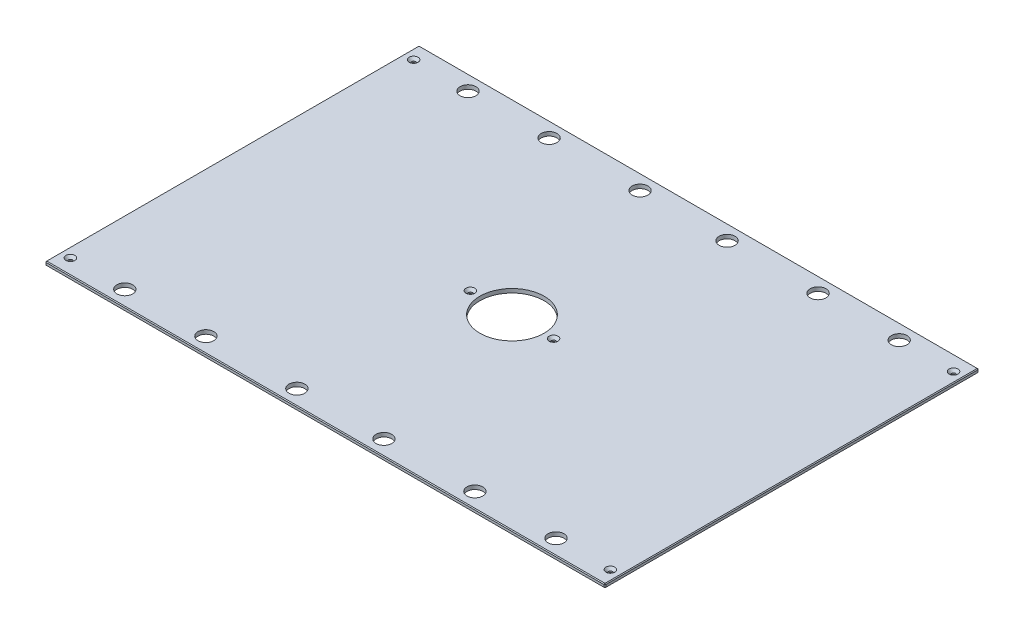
ISO-10303-21;
HEADER;
FILE_DESCRIPTION(('STEP AP214'),'2;1');
FILE_NAME('part.step','',(''),(''),'','','');
FILE_SCHEMA(('AUTOMOTIVE_DESIGN { 1 0 10303 214 1 1 1 1 }'));
ENDSEC;
DATA;
#1=APPLICATION_CONTEXT('core data for automotive mechanical design processes');
#2=APPLICATION_PROTOCOL_DEFINITION('international standard','automotive_design',2000,#1);
#3=PRODUCT_CONTEXT('',#1,'mechanical');
#4=PRODUCT('Part','Part','',(#3));
#5=PRODUCT_RELATED_PRODUCT_CATEGORY('part','',(#4));
#6=PRODUCT_DEFINITION_FORMATION('','',#4);
#7=PRODUCT_DEFINITION_CONTEXT('part definition',#1,'design');
#8=PRODUCT_DEFINITION('design','',#6,#7);
#9=PRODUCT_DEFINITION_SHAPE('','',#8);
#10=(LENGTH_UNIT() NAMED_UNIT(*) SI_UNIT(.MILLI.,.METRE.));
#11=(NAMED_UNIT(*) PLANE_ANGLE_UNIT() SI_UNIT($,.RADIAN.));
#12=(NAMED_UNIT(*) SI_UNIT($,.STERADIAN.) SOLID_ANGLE_UNIT());
#13=UNCERTAINTY_MEASURE_WITH_UNIT(LENGTH_MEASURE(1.E-05),#10,'distance_accuracy_value','');
#14=(GEOMETRIC_REPRESENTATION_CONTEXT(3) GLOBAL_UNCERTAINTY_ASSIGNED_CONTEXT((#13)) GLOBAL_UNIT_ASSIGNED_CONTEXT((#10,
#11,#12)) REPRESENTATION_CONTEXT('',''));
#15=CARTESIAN_POINT('',(0.,0.,0.));
#16=DIRECTION('',(0.,0.,1.));
#17=DIRECTION('',(1.,0.,0.));
#18=AXIS2_PLACEMENT_3D('',#15,#16,#17);
#19=CARTESIAN_POINT('',(-449.2625,6.35,-300.0375));
#20=DIRECTION('',(1.,0.,0.));
#21=DIRECTION('',(0.,0.,-1.));
#22=AXIS2_PLACEMENT_3D('',#19,#20,#21);
#23=PLANE('',#22);
#24=DIRECTION('',(0.,0.,-1.));
#25=VECTOR('',#24,1.);
#26=CARTESIAN_POINT('',(-449.2625,5.08000000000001,-300.0375));
#27=LINE('',#26,#25);
#28=CARTESIAN_POINT('',(-449.2625,5.08000000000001,298.7675));
#29=VERTEX_POINT('',#28);
#30=CARTESIAN_POINT('',(-449.2625,5.08000000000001,-298.7675));
#31=VERTEX_POINT('',#30);
#32=EDGE_CURVE('E134',#29,#31,#27,.T.);
#33=ORIENTED_EDGE('',*,*,#32,.T.);
#34=DIRECTION('',(0.,-1.,0.));
#35=VECTOR('',#34,1.);
#36=CARTESIAN_POINT('',(-449.2625,6.35,-298.7675));
#37=LINE('',#36,#35);
#38=CARTESIAN_POINT('',(-449.2625,1.26999999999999,-298.7675));
#39=VERTEX_POINT('',#38);
#40=EDGE_CURVE('E130',#31,#39,#37,.T.);
#41=ORIENTED_EDGE('',*,*,#40,.T.);
#42=DIRECTION('',(0.,0.,1.));
#43=VECTOR('',#42,1.);
#44=CARTESIAN_POINT('',(-449.2625,1.26999999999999,-300.0375));
#45=LINE('',#44,#43);
#46=CARTESIAN_POINT('',(-449.2625,1.26999999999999,298.7675));
#47=VERTEX_POINT('',#46);
#48=EDGE_CURVE('E125',#39,#47,#45,.T.);
#49=ORIENTED_EDGE('',*,*,#48,.T.);
#50=DIRECTION('',(0.,1.,0.));
#51=VECTOR('',#50,1.);
#52=CARTESIAN_POINT('',(-449.2625,6.35,298.7675));
#53=LINE('',#52,#51);
#54=EDGE_CURVE('E127',#47,#29,#53,.T.);
#55=ORIENTED_EDGE('',*,*,#54,.T.);
#56=EDGE_LOOP('',(#33,#41,#49,#55));
#57=FACE_BOUND('',#56,.T.);
#58=ADVANCED_FACE('F34',(#57),#23,.F.);
#59=CARTESIAN_POINT('',(-449.2625,6.35,300.0375));
#60=DIRECTION('',(0.,0.,-1.));
#61=DIRECTION('',(-1.,0.,0.));
#62=AXIS2_PLACEMENT_3D('',#59,#60,#61);
#63=PLANE('',#62);
#64=DIRECTION('',(1.,0.,0.));
#65=VECTOR('',#64,1.);
#66=CARTESIAN_POINT('',(-449.2625,1.26999999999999,300.0375));
#67=LINE('',#66,#65);
#68=CARTESIAN_POINT('',(-447.9925,1.26999999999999,300.0375));
#69=VERTEX_POINT('',#68);
#70=CARTESIAN_POINT('',(447.9925,1.26999999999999,300.0375));
#71=VERTEX_POINT('',#70);
#72=EDGE_CURVE('E57',#69,#71,#67,.T.);
#73=ORIENTED_EDGE('',*,*,#72,.T.);
#74=DIRECTION('',(0.,1.,0.));
#75=VECTOR('',#74,1.);
#76=CARTESIAN_POINT('',(447.9925,6.35,300.0375));
#77=LINE('',#76,#75);
#78=CARTESIAN_POINT('',(447.9925,5.08000000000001,300.0375));
#79=VERTEX_POINT('',#78);
#80=EDGE_CURVE('E11',#71,#79,#77,.T.);
#81=ORIENTED_EDGE('',*,*,#80,.T.);
#82=DIRECTION('',(-1.,0.,0.));
#83=VECTOR('',#82,1.);
#84=CARTESIAN_POINT('',(-449.2625,5.08000000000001,300.0375));
#85=LINE('',#84,#83);
#86=CARTESIAN_POINT('',(-447.9925,5.08000000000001,300.0375));
#87=VERTEX_POINT('',#86);
#88=EDGE_CURVE('E43',#79,#87,#85,.T.);
#89=ORIENTED_EDGE('',*,*,#88,.T.);
#90=DIRECTION('',(0.,-1.,0.));
#91=VECTOR('',#90,1.);
#92=CARTESIAN_POINT('',(-447.9925,6.35,300.0375));
#93=LINE('',#92,#91);
#94=EDGE_CURVE('E326',#87,#69,#93,.T.);
#95=ORIENTED_EDGE('',*,*,#94,.T.);
#96=EDGE_LOOP('',(#73,#81,#89,#95));
#97=FACE_BOUND('',#96,.T.);
#98=ADVANCED_FACE('F395',(#97),#63,.F.);
#99=CARTESIAN_POINT('',(449.2625,6.35,-300.0375));
#100=DIRECTION('',(-1.,0.,0.));
#101=DIRECTION('',(0.,0.,1.));
#102=AXIS2_PLACEMENT_3D('',#99,#100,#101);
#103=PLANE('',#102);
#104=DIRECTION('',(0.,0.,-1.));
#105=VECTOR('',#104,1.);
#106=CARTESIAN_POINT('',(449.2625,1.26999999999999,-300.0375));
#107=LINE('',#106,#105);
#108=CARTESIAN_POINT('',(449.2625,1.26999999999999,298.7675));
#109=VERTEX_POINT('',#108);
#110=CARTESIAN_POINT('',(449.2625,1.26999999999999,-298.7675));
#111=VERTEX_POINT('',#110);
#112=EDGE_CURVE('E321',#109,#111,#107,.T.);
#113=ORIENTED_EDGE('',*,*,#112,.T.);
#114=DIRECTION('',(0.,1.,0.));
#115=VECTOR('',#114,1.);
#116=CARTESIAN_POINT('',(449.2625,6.35,-298.7675));
#117=LINE('',#116,#115);
#118=CARTESIAN_POINT('',(449.2625,5.08000000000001,-298.7675));
#119=VERTEX_POINT('',#118);
#120=EDGE_CURVE('E323',#111,#119,#117,.T.);
#121=ORIENTED_EDGE('',*,*,#120,.T.);
#122=DIRECTION('',(0.,0.,1.));
#123=VECTOR('',#122,1.);
#124=CARTESIAN_POINT('',(449.2625,5.08000000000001,300.0375));
#125=LINE('',#124,#123);
#126=CARTESIAN_POINT('',(449.2625,5.08000000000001,298.7675));
#127=VERTEX_POINT('',#126);
#128=EDGE_CURVE('E319',#119,#127,#125,.T.);
#129=ORIENTED_EDGE('',*,*,#128,.T.);
#130=DIRECTION('',(0.,-1.,0.));
#131=VECTOR('',#130,1.);
#132=CARTESIAN_POINT('',(449.2625,6.35,298.7675));
#133=LINE('',#132,#131);
#134=EDGE_CURVE('E317',#127,#109,#133,.T.);
#135=ORIENTED_EDGE('',*,*,#134,.T.);
#136=EDGE_LOOP('',(#113,#121,#129,#135));
#137=FACE_BOUND('',#136,.T.);
#138=ADVANCED_FACE('F382',(#137),#103,.F.);
#139=CARTESIAN_POINT('',(-449.2625,6.35,-300.0375));
#140=DIRECTION('',(0.,0.,1.));
#141=DIRECTION('',(1.,0.,0.));
#142=AXIS2_PLACEMENT_3D('',#139,#140,#141);
#143=PLANE('',#142);
#144=DIRECTION('',(-1.,0.,0.));
#145=VECTOR('',#144,1.);
#146=CARTESIAN_POINT('',(-449.2625,1.26999999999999,-300.0375));
#147=LINE('',#146,#145);
#148=CARTESIAN_POINT('',(447.9925,1.26999999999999,-300.0375));
#149=VERTEX_POINT('',#148);
#150=CARTESIAN_POINT('',(-447.9925,1.26999999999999,-300.0375));
#151=VERTEX_POINT('',#150);
#152=EDGE_CURVE('E293',#149,#151,#147,.T.);
#153=ORIENTED_EDGE('',*,*,#152,.T.);
#154=DIRECTION('',(0.,1.,0.));
#155=VECTOR('',#154,1.);
#156=CARTESIAN_POINT('',(-447.9925,6.35,-300.0375));
#157=LINE('',#156,#155);
#158=CARTESIAN_POINT('',(-447.9925,5.08000000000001,-300.0375));
#159=VERTEX_POINT('',#158);
#160=EDGE_CURVE('E297',#151,#159,#157,.T.);
#161=ORIENTED_EDGE('',*,*,#160,.T.);
#162=DIRECTION('',(1.,0.,0.));
#163=VECTOR('',#162,1.);
#164=CARTESIAN_POINT('',(449.2625,5.08000000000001,-300.0375));
#165=LINE('',#164,#163);
#166=CARTESIAN_POINT('',(447.9925,5.08000000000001,-300.0375));
#167=VERTEX_POINT('',#166);
#168=EDGE_CURVE('E295',#159,#167,#165,.T.);
#169=ORIENTED_EDGE('',*,*,#168,.T.);
#170=DIRECTION('',(0.,-1.,0.));
#171=VECTOR('',#170,1.);
#172=CARTESIAN_POINT('',(447.9925,6.35,-300.0375));
#173=LINE('',#172,#171);
#174=EDGE_CURVE('E291',#167,#149,#173,.T.);
#175=ORIENTED_EDGE('',*,*,#174,.T.);
#176=EDGE_LOOP('',(#153,#161,#169,#175));
#177=FACE_BOUND('',#176,.T.);
#178=ADVANCED_FACE('F356',(#177),#143,.F.);
#179=CARTESIAN_POINT('',(0.,6.35,0.));
#180=DIRECTION('',(0.,1.,0.));
#181=DIRECTION('',(0.,0.,1.));
#182=AXIS2_PLACEMENT_3D('',#179,#180,#181);
#183=PLANE('',#182);
#184=CARTESIAN_POINT('',(433.3875,6.35,-275.42998));
#185=DIRECTION('',(0.,1.,0.));
#186=DIRECTION('',(0.,0.,1.));
#187=AXIS2_PLACEMENT_3D('',#184,#185,#186);
#188=CIRCLE('',#187,7.13740000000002);
#189=CARTESIAN_POINT('',(433.3875,6.35,-268.29258));
#190=VERTEX_POINT('',#189);
#191=EDGE_CURVE('E879',#190,#190,#188,.T.);
#192=ORIENTED_EDGE('',*,*,#191,.F.);
#193=EDGE_LOOP('',(#192));
#194=FACE_BOUND('',#193,.T.);
#195=CARTESIAN_POINT('',(433.3875,6.35,275.42998));
#196=DIRECTION('',(0.,1.,0.));
#197=DIRECTION('',(0.,0.,1.));
#198=AXIS2_PLACEMENT_3D('',#195,#196,#197);
#199=CIRCLE('',#198,7.13740000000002);
#200=CARTESIAN_POINT('',(433.3875,6.35,282.56738));
#201=VERTEX_POINT('',#200);
#202=EDGE_CURVE('E883',#201,#201,#199,.T.);
#203=ORIENTED_EDGE('',*,*,#202,.F.);
#204=EDGE_LOOP('',(#203));
#205=FACE_BOUND('',#204,.T.);
#206=CARTESIAN_POINT('',(-433.3875,6.35,275.42998));
#207=DIRECTION('',(0.,1.,0.));
#208=DIRECTION('',(0.,0.,1.));
#209=AXIS2_PLACEMENT_3D('',#206,#207,#208);
#210=CIRCLE('',#209,7.13740000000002);
#211=CARTESIAN_POINT('',(-433.3875,6.35,282.56738));
#212=VERTEX_POINT('',#211);
#213=EDGE_CURVE('E887',#212,#212,#210,.T.);
#214=ORIENTED_EDGE('',*,*,#213,.F.);
#215=EDGE_LOOP('',(#214));
#216=FACE_BOUND('',#215,.T.);
#217=CARTESIAN_POINT('',(-66.675,6.35,0.));
#218=DIRECTION('',(0.,1.,0.));
#219=DIRECTION('',(0.,0.,1.));
#220=AXIS2_PLACEMENT_3D('',#217,#218,#219);
#221=CIRCLE('',#220,7.1374);
#222=CARTESIAN_POINT('',(-66.675,6.35,7.1374));
#223=VERTEX_POINT('',#222);
#224=EDGE_CURVE('E891',#223,#223,#221,.T.);
#225=ORIENTED_EDGE('',*,*,#224,.F.);
#226=EDGE_LOOP('',(#225));
#227=FACE_BOUND('',#226,.T.);
#228=CARTESIAN_POINT('',(66.675,6.35,0.));
#229=DIRECTION('',(0.,1.,0.));
#230=DIRECTION('',(0.,0.,1.));
#231=AXIS2_PLACEMENT_3D('',#228,#229,#230);
#232=CIRCLE('',#231,7.1374);
#233=CARTESIAN_POINT('',(66.675,6.35,7.1374));
#234=VERTEX_POINT('',#233);
#235=EDGE_CURVE('E895',#234,#234,#232,.T.);
#236=ORIENTED_EDGE('',*,*,#235,.F.);
#237=EDGE_LOOP('',(#236));
#238=FACE_BOUND('',#237,.T.);
#239=CARTESIAN_POINT('',(-433.3875,6.35,-275.42998));
#240=DIRECTION('',(0.,1.,0.));
#241=DIRECTION('',(0.,0.,1.));
#242=AXIS2_PLACEMENT_3D('',#239,#240,#241);
#243=CIRCLE('',#242,7.13740000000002);
#244=CARTESIAN_POINT('',(-433.3875,6.35,-268.29258));
#245=VERTEX_POINT('',#244);
#246=EDGE_CURVE('E898',#245,#245,#243,.T.);
#247=ORIENTED_EDGE('',*,*,#246,.F.);
#248=EDGE_LOOP('',(#247));
#249=FACE_BOUND('',#248,.T.);
#250=DIRECTION('',(0.,0.,-1.));
#251=VECTOR('',#250,1.);
#252=CARTESIAN_POINT('',(447.9925,6.35,-300.0375));
#253=LINE('',#252,#251);
#254=CARTESIAN_POINT('',(447.9925,6.35,298.7675));
#255=VERTEX_POINT('',#254);
#256=CARTESIAN_POINT('',(447.9925,6.35,-298.7675));
#257=VERTEX_POINT('',#256);
#258=EDGE_CURVE('E304',#255,#257,#253,.T.);
#259=ORIENTED_EDGE('',*,*,#258,.T.);
#260=DIRECTION('',(-1.,0.,0.));
#261=VECTOR('',#260,1.);
#262=CARTESIAN_POINT('',(-449.2625,6.35,-298.7675));
#263=LINE('',#262,#261);
#264=CARTESIAN_POINT('',(-447.9925,6.35,-298.7675));
#265=VERTEX_POINT('',#264);
#266=EDGE_CURVE('E306',#257,#265,#263,.T.);
#267=ORIENTED_EDGE('',*,*,#266,.T.);
#268=DIRECTION('',(0.,0.,1.));
#269=VECTOR('',#268,1.);
#270=CARTESIAN_POINT('',(-447.9925,6.35,300.0375));
#271=LINE('',#270,#269);
#272=CARTESIAN_POINT('',(-447.9925,6.35,298.7675));
#273=VERTEX_POINT('',#272);
#274=EDGE_CURVE('E302',#265,#273,#271,.T.);
#275=ORIENTED_EDGE('',*,*,#274,.T.);
#276=DIRECTION('',(1.,0.,0.));
#277=VECTOR('',#276,1.);
#278=CARTESIAN_POINT('',(449.2625,6.35,298.7675));
#279=LINE('',#278,#277);
#280=EDGE_CURVE('E300',#273,#255,#279,.T.);
#281=ORIENTED_EDGE('',*,*,#280,.T.);
#282=EDGE_LOOP('',(#259,#267,#275,#281));
#283=FACE_BOUND('',#282,.T.);
#284=CARTESIAN_POINT('',(346.075,6.35,-275.42998));
#285=DIRECTION('',(0.,1.,0.));
#286=DIRECTION('',(0.,0.,1.));
#287=AXIS2_PLACEMENT_3D('',#284,#285,#286);
#288=CIRCLE('',#287,12.7);
#289=CARTESIAN_POINT('',(346.075,6.35,-262.72998));
#290=VERTEX_POINT('',#289);
#291=EDGE_CURVE('E203',#290,#290,#288,.T.);
#292=ORIENTED_EDGE('',*,*,#291,.F.);
#293=EDGE_LOOP('',(#292));
#294=FACE_BOUND('',#293,.T.);
#295=CARTESIAN_POINT('',(-346.075,6.35,-275.42998));
#296=DIRECTION('',(0.,1.,0.));
#297=DIRECTION('',(0.,0.,1.));
#298=AXIS2_PLACEMENT_3D('',#295,#296,#297);
#299=CIRCLE('',#298,12.7);
#300=CARTESIAN_POINT('',(-346.075,6.35,-262.72998));
#301=VERTEX_POINT('',#300);
#302=EDGE_CURVE('E213',#301,#301,#299,.T.);
#303=ORIENTED_EDGE('',*,*,#302,.F.);
#304=EDGE_LOOP('',(#303));
#305=FACE_BOUND('',#304,.T.);
#306=CARTESIAN_POINT('',(346.075,6.35,275.42998));
#307=DIRECTION('',(0.,1.,0.));
#308=DIRECTION('',(0.,0.,1.));
#309=AXIS2_PLACEMENT_3D('',#306,#307,#308);
#310=CIRCLE('',#309,12.7);
#311=CARTESIAN_POINT('',(346.075,6.35,288.12998));
#312=VERTEX_POINT('',#311);
#313=EDGE_CURVE('E224',#312,#312,#310,.T.);
#314=ORIENTED_EDGE('',*,*,#313,.F.);
#315=EDGE_LOOP('',(#314));
#316=FACE_BOUND('',#315,.T.);
#317=CARTESIAN_POINT('',(-346.075,6.35,275.42998));
#318=DIRECTION('',(0.,1.,0.));
#319=DIRECTION('',(0.,0.,1.));
#320=AXIS2_PLACEMENT_3D('',#317,#318,#319);
#321=CIRCLE('',#320,12.7);
#322=CARTESIAN_POINT('',(-346.075,6.35,288.12998));
#323=VERTEX_POINT('',#322);
#324=EDGE_CURVE('E230',#323,#323,#321,.T.);
#325=ORIENTED_EDGE('',*,*,#324,.F.);
#326=EDGE_LOOP('',(#325));
#327=FACE_BOUND('',#326,.T.);
#328=CARTESIAN_POINT('',(-215.9,6.35,-275.42998));
#329=DIRECTION('',(0.,1.,0.));
#330=DIRECTION('',(0.,0.,1.));
#331=AXIS2_PLACEMENT_3D('',#328,#329,#330);
#332=CIRCLE('',#331,12.7);
#333=CARTESIAN_POINT('',(-215.9,6.35,-262.72998));
#334=VERTEX_POINT('',#333);
#335=EDGE_CURVE('E236',#334,#334,#332,.T.);
#336=ORIENTED_EDGE('',*,*,#335,.F.);
#337=EDGE_LOOP('',(#336));
#338=FACE_BOUND('',#337,.T.);
#339=CARTESIAN_POINT('',(215.9,6.35,-275.42998));
#340=DIRECTION('',(0.,1.,0.));
#341=DIRECTION('',(0.,0.,1.));
#342=AXIS2_PLACEMENT_3D('',#339,#340,#341);
#343=CIRCLE('',#342,12.7);
#344=CARTESIAN_POINT('',(215.9,6.35,-262.72998));
#345=VERTEX_POINT('',#344);
#346=EDGE_CURVE('E242',#345,#345,#343,.T.);
#347=ORIENTED_EDGE('',*,*,#346,.F.);
#348=EDGE_LOOP('',(#347));
#349=FACE_BOUND('',#348,.T.);
#350=CARTESIAN_POINT('',(215.9,6.35,275.42998));
#351=DIRECTION('',(0.,1.,0.));
#352=DIRECTION('',(0.,0.,1.));
#353=AXIS2_PLACEMENT_3D('',#350,#351,#352);
#354=CIRCLE('',#353,12.7);
#355=CARTESIAN_POINT('',(215.9,6.35,288.12998));
#356=VERTEX_POINT('',#355);
#357=EDGE_CURVE('E248',#356,#356,#354,.T.);
#358=ORIENTED_EDGE('',*,*,#357,.F.);
#359=EDGE_LOOP('',(#358));
#360=FACE_BOUND('',#359,.T.);
#361=CARTESIAN_POINT('',(-215.9,6.35,275.42998));
#362=DIRECTION('',(0.,1.,0.));
#363=DIRECTION('',(0.,0.,1.));
#364=AXIS2_PLACEMENT_3D('',#361,#362,#363);
#365=CIRCLE('',#364,12.7);
#366=CARTESIAN_POINT('',(-215.9,6.35,288.12998));
#367=VERTEX_POINT('',#366);
#368=EDGE_CURVE('E254',#367,#367,#365,.T.);
#369=ORIENTED_EDGE('',*,*,#368,.F.);
#370=EDGE_LOOP('',(#369));
#371=FACE_BOUND('',#370,.T.);
#372=CARTESIAN_POINT('',(69.85,6.35,-275.42998));
#373=DIRECTION('',(0.,1.,0.));
#374=DIRECTION('',(0.,0.,1.));
#375=AXIS2_PLACEMENT_3D('',#372,#373,#374);
#376=CIRCLE('',#375,12.7);
#377=CARTESIAN_POINT('',(69.85,6.35,-262.72998));
#378=VERTEX_POINT('',#377);
#379=EDGE_CURVE('E260',#378,#378,#376,.T.);
#380=ORIENTED_EDGE('',*,*,#379,.F.);
#381=EDGE_LOOP('',(#380));
#382=FACE_BOUND('',#381,.T.);
#383=CARTESIAN_POINT('',(-69.85,6.35,-275.42998));
#384=DIRECTION('',(0.,1.,0.));
#385=DIRECTION('',(0.,0.,1.));
#386=AXIS2_PLACEMENT_3D('',#383,#384,#385);
#387=CIRCLE('',#386,12.7);
#388=CARTESIAN_POINT('',(-69.85,6.35,-262.72998));
#389=VERTEX_POINT('',#388);
#390=EDGE_CURVE('E266',#389,#389,#387,.T.);
#391=ORIENTED_EDGE('',*,*,#390,.F.);
#392=EDGE_LOOP('',(#391));
#393=FACE_BOUND('',#392,.T.);
#394=CARTESIAN_POINT('',(-69.85,6.35,275.42998));
#395=DIRECTION('',(0.,1.,0.));
#396=DIRECTION('',(0.,0.,1.));
#397=AXIS2_PLACEMENT_3D('',#394,#395,#396);
#398=CIRCLE('',#397,12.7);
#399=CARTESIAN_POINT('',(-69.85,6.35,288.12998));
#400=VERTEX_POINT('',#399);
#401=EDGE_CURVE('E272',#400,#400,#398,.T.);
#402=ORIENTED_EDGE('',*,*,#401,.F.);
#403=EDGE_LOOP('',(#402));
#404=FACE_BOUND('',#403,.T.);
#405=CARTESIAN_POINT('',(69.85,6.35,275.42998));
#406=DIRECTION('',(0.,1.,0.));
#407=DIRECTION('',(0.,0.,1.));
#408=AXIS2_PLACEMENT_3D('',#405,#406,#407);
#409=CIRCLE('',#408,12.7);
#410=CARTESIAN_POINT('',(69.85,6.35,288.12998));
#411=VERTEX_POINT('',#410);
#412=EDGE_CURVE('E278',#411,#411,#409,.T.);
#413=ORIENTED_EDGE('',*,*,#412,.F.);
#414=EDGE_LOOP('',(#413));
#415=FACE_BOUND('',#414,.T.);
#416=CARTESIAN_POINT('',(0.,6.35,0.));
#417=DIRECTION('',(0.,1.,0.));
#418=DIRECTION('',(0.,0.,1.));
#419=AXIS2_PLACEMENT_3D('',#416,#417,#418);
#420=CIRCLE('',#419,51.562);
#421=CARTESIAN_POINT('',(0.,6.35,51.562));
#422=VERTEX_POINT('',#421);
#423=EDGE_CURVE('E284',#422,#422,#420,.T.);
#424=ORIENTED_EDGE('',*,*,#423,.F.);
#425=EDGE_LOOP('',(#424));
#426=FACE_BOUND('',#425,.T.);
#427=ADVANCED_FACE('F404',(#194,#205,#216,#227,#238,#249,#283,#294,#305,#316,#327,#338,#349,
#360,#371,#382,#393,#404,#415,#426),#183,.T.);
#428=CARTESIAN_POINT('',(0.,0.,0.));
#429=DIRECTION('',(0.,1.,0.));
#430=DIRECTION('',(0.,0.,1.));
#431=AXIS2_PLACEMENT_3D('',#428,#429,#430);
#432=PLANE('',#431);
#433=CARTESIAN_POINT('',(433.3875,0.,-275.42998));
#434=DIRECTION('',(0.,1.,0.));
#435=DIRECTION('',(0.,0.,1.));
#436=AXIS2_PLACEMENT_3D('',#433,#434,#435);
#437=CIRCLE('',#436,3.3782);
#438=CARTESIAN_POINT('',(433.3875,0.,-272.05178));
#439=VERTEX_POINT('',#438);
#440=EDGE_CURVE('E932',#439,#439,#437,.T.);
#441=ORIENTED_EDGE('',*,*,#440,.T.);
#442=EDGE_LOOP('',(#441));
#443=FACE_BOUND('',#442,.T.);
#444=CARTESIAN_POINT('',(433.3875,0.,275.42998));
#445=DIRECTION('',(0.,1.,0.));
#446=DIRECTION('',(0.,0.,1.));
#447=AXIS2_PLACEMENT_3D('',#444,#445,#446);
#448=CIRCLE('',#447,3.3782);
#449=CARTESIAN_POINT('',(433.3875,0.,278.80818));
#450=VERTEX_POINT('',#449);
#451=EDGE_CURVE('E925',#450,#450,#448,.T.);
#452=ORIENTED_EDGE('',*,*,#451,.T.);
#453=EDGE_LOOP('',(#452));
#454=FACE_BOUND('',#453,.T.);
#455=CARTESIAN_POINT('',(-433.3875,0.,275.42998));
#456=DIRECTION('',(0.,1.,0.));
#457=DIRECTION('',(0.,0.,1.));
#458=AXIS2_PLACEMENT_3D('',#455,#456,#457);
#459=CIRCLE('',#458,3.3782);
#460=CARTESIAN_POINT('',(-433.3875,0.,278.80818));
#461=VERTEX_POINT('',#460);
#462=EDGE_CURVE('E918',#461,#461,#459,.T.);
#463=ORIENTED_EDGE('',*,*,#462,.T.);
#464=EDGE_LOOP('',(#463));
#465=FACE_BOUND('',#464,.T.);
#466=CARTESIAN_POINT('',(-66.675,0.,0.));
#467=DIRECTION('',(0.,1.,0.));
#468=DIRECTION('',(0.,0.,1.));
#469=AXIS2_PLACEMENT_3D('',#466,#467,#468);
#470=CIRCLE('',#469,3.3782);
#471=CARTESIAN_POINT('',(-66.675,0.,3.3782));
#472=VERTEX_POINT('',#471);
#473=EDGE_CURVE('E911',#472,#472,#470,.T.);
#474=ORIENTED_EDGE('',*,*,#473,.T.);
#475=EDGE_LOOP('',(#474));
#476=FACE_BOUND('',#475,.T.);
#477=CARTESIAN_POINT('',(66.675,0.,0.));
#478=DIRECTION('',(0.,1.,0.));
#479=DIRECTION('',(0.,0.,1.));
#480=AXIS2_PLACEMENT_3D('',#477,#478,#479);
#481=CIRCLE('',#480,3.3782);
#482=CARTESIAN_POINT('',(66.675,0.,3.3782));
#483=VERTEX_POINT('',#482);
#484=EDGE_CURVE('E901',#483,#483,#481,.T.);
#485=ORIENTED_EDGE('',*,*,#484,.T.);
#486=EDGE_LOOP('',(#485));
#487=FACE_BOUND('',#486,.T.);
#488=CARTESIAN_POINT('',(-433.3875,0.,-275.42998));
#489=DIRECTION('',(0.,1.,0.));
#490=DIRECTION('',(0.,0.,1.));
#491=AXIS2_PLACEMENT_3D('',#488,#489,#490);
#492=CIRCLE('',#491,3.3782);
#493=CARTESIAN_POINT('',(-433.3875,0.,-272.05178));
#494=VERTEX_POINT('',#493);
#495=EDGE_CURVE('E216',#494,#494,#492,.T.);
#496=ORIENTED_EDGE('',*,*,#495,.T.);
#497=EDGE_LOOP('',(#496));
#498=FACE_BOUND('',#497,.T.);
#499=DIRECTION('',(0.,0.,-1.));
#500=VECTOR('',#499,1.);
#501=CARTESIAN_POINT('',(-447.9925,0.,0.));
#502=LINE('',#501,#500);
#503=CARTESIAN_POINT('',(-447.9925,0.,298.7675));
#504=VERTEX_POINT('',#503);
#505=CARTESIAN_POINT('',(-447.9925,0.,-298.7675));
#506=VERTEX_POINT('',#505);
#507=EDGE_CURVE('E157',#504,#506,#502,.T.);
#508=ORIENTED_EDGE('',*,*,#507,.T.);
#509=DIRECTION('',(1.,0.,0.));
#510=VECTOR('',#509,1.);
#511=CARTESIAN_POINT('',(0.,0.,-298.7675));
#512=LINE('',#511,#510);
#513=CARTESIAN_POINT('',(447.9925,0.,-298.7675));
#514=VERTEX_POINT('',#513);
#515=EDGE_CURVE('E314',#506,#514,#512,.T.);
#516=ORIENTED_EDGE('',*,*,#515,.T.);
#517=DIRECTION('',(0.,0.,1.));
#518=VECTOR('',#517,1.);
#519=CARTESIAN_POINT('',(447.9925,0.,0.));
#520=LINE('',#519,#518);
#521=CARTESIAN_POINT('',(447.9925,0.,298.7675));
#522=VERTEX_POINT('',#521);
#523=EDGE_CURVE('E312',#514,#522,#520,.T.);
#524=ORIENTED_EDGE('',*,*,#523,.T.);
#525=DIRECTION('',(-1.,0.,0.));
#526=VECTOR('',#525,1.);
#527=CARTESIAN_POINT('',(0.,0.,298.7675));
#528=LINE('',#527,#526);
#529=EDGE_CURVE('E309',#522,#504,#528,.T.);
#530=ORIENTED_EDGE('',*,*,#529,.T.);
#531=EDGE_LOOP('',(#508,#516,#524,#530));
#532=FACE_BOUND('',#531,.T.);
#533=CARTESIAN_POINT('',(346.075,0.,-275.42998));
#534=DIRECTION('',(0.,1.,0.));
#535=DIRECTION('',(0.,0.,1.));
#536=AXIS2_PLACEMENT_3D('',#533,#534,#535);
#537=CIRCLE('',#536,12.7);
#538=CARTESIAN_POINT('',(346.075,0.,-262.72998));
#539=VERTEX_POINT('',#538);
#540=EDGE_CURVE('E208',#539,#539,#537,.T.);
#541=ORIENTED_EDGE('',*,*,#540,.T.);
#542=EDGE_LOOP('',(#541));
#543=FACE_BOUND('',#542,.T.);
#544=CARTESIAN_POINT('',(-346.075,0.,-275.42998));
#545=DIRECTION('',(0.,1.,0.));
#546=DIRECTION('',(0.,0.,1.));
#547=AXIS2_PLACEMENT_3D('',#544,#545,#546);
#548=CIRCLE('',#547,12.7);
#549=CARTESIAN_POINT('',(-346.075,0.,-262.72998));
#550=VERTEX_POINT('',#549);
#551=EDGE_CURVE('E221',#550,#550,#548,.T.);
#552=ORIENTED_EDGE('',*,*,#551,.T.);
#553=EDGE_LOOP('',(#552));
#554=FACE_BOUND('',#553,.T.);
#555=CARTESIAN_POINT('',(346.075,0.,275.42998));
#556=DIRECTION('',(0.,1.,0.));
#557=DIRECTION('',(0.,0.,1.));
#558=AXIS2_PLACEMENT_3D('',#555,#556,#557);
#559=CIRCLE('',#558,12.7);
#560=CARTESIAN_POINT('',(346.075,0.,288.12998));
#561=VERTEX_POINT('',#560);
#562=EDGE_CURVE('E227',#561,#561,#559,.T.);
#563=ORIENTED_EDGE('',*,*,#562,.T.);
#564=EDGE_LOOP('',(#563));
#565=FACE_BOUND('',#564,.T.);
#566=CARTESIAN_POINT('',(-346.075,0.,275.42998));
#567=DIRECTION('',(0.,1.,0.));
#568=DIRECTION('',(0.,0.,1.));
#569=AXIS2_PLACEMENT_3D('',#566,#567,#568);
#570=CIRCLE('',#569,12.7);
#571=CARTESIAN_POINT('',(-346.075,0.,288.12998));
#572=VERTEX_POINT('',#571);
#573=EDGE_CURVE('E233',#572,#572,#570,.T.);
#574=ORIENTED_EDGE('',*,*,#573,.T.);
#575=EDGE_LOOP('',(#574));
#576=FACE_BOUND('',#575,.T.);
#577=CARTESIAN_POINT('',(-215.9,0.,-275.42998));
#578=DIRECTION('',(0.,1.,0.));
#579=DIRECTION('',(0.,0.,1.));
#580=AXIS2_PLACEMENT_3D('',#577,#578,#579);
#581=CIRCLE('',#580,12.7);
#582=CARTESIAN_POINT('',(-215.9,0.,-262.72998));
#583=VERTEX_POINT('',#582);
#584=EDGE_CURVE('E239',#583,#583,#581,.T.);
#585=ORIENTED_EDGE('',*,*,#584,.T.);
#586=EDGE_LOOP('',(#585));
#587=FACE_BOUND('',#586,.T.);
#588=CARTESIAN_POINT('',(215.9,0.,-275.42998));
#589=DIRECTION('',(0.,1.,0.));
#590=DIRECTION('',(0.,0.,1.));
#591=AXIS2_PLACEMENT_3D('',#588,#589,#590);
#592=CIRCLE('',#591,12.7);
#593=CARTESIAN_POINT('',(215.9,0.,-262.72998));
#594=VERTEX_POINT('',#593);
#595=EDGE_CURVE('E245',#594,#594,#592,.T.);
#596=ORIENTED_EDGE('',*,*,#595,.T.);
#597=EDGE_LOOP('',(#596));
#598=FACE_BOUND('',#597,.T.);
#599=CARTESIAN_POINT('',(215.9,0.,275.42998));
#600=DIRECTION('',(0.,1.,0.));
#601=DIRECTION('',(0.,0.,1.));
#602=AXIS2_PLACEMENT_3D('',#599,#600,#601);
#603=CIRCLE('',#602,12.7);
#604=CARTESIAN_POINT('',(215.9,0.,288.12998));
#605=VERTEX_POINT('',#604);
#606=EDGE_CURVE('E251',#605,#605,#603,.T.);
#607=ORIENTED_EDGE('',*,*,#606,.T.);
#608=EDGE_LOOP('',(#607));
#609=FACE_BOUND('',#608,.T.);
#610=CARTESIAN_POINT('',(-215.9,0.,275.42998));
#611=DIRECTION('',(0.,1.,0.));
#612=DIRECTION('',(0.,0.,1.));
#613=AXIS2_PLACEMENT_3D('',#610,#611,#612);
#614=CIRCLE('',#613,12.7);
#615=CARTESIAN_POINT('',(-215.9,0.,288.12998));
#616=VERTEX_POINT('',#615);
#617=EDGE_CURVE('E257',#616,#616,#614,.T.);
#618=ORIENTED_EDGE('',*,*,#617,.T.);
#619=EDGE_LOOP('',(#618));
#620=FACE_BOUND('',#619,.T.);
#621=CARTESIAN_POINT('',(69.85,0.,-275.42998));
#622=DIRECTION('',(0.,1.,0.));
#623=DIRECTION('',(0.,0.,1.));
#624=AXIS2_PLACEMENT_3D('',#621,#622,#623);
#625=CIRCLE('',#624,12.7);
#626=CARTESIAN_POINT('',(69.85,0.,-262.72998));
#627=VERTEX_POINT('',#626);
#628=EDGE_CURVE('E263',#627,#627,#625,.T.);
#629=ORIENTED_EDGE('',*,*,#628,.T.);
#630=EDGE_LOOP('',(#629));
#631=FACE_BOUND('',#630,.T.);
#632=CARTESIAN_POINT('',(-69.85,0.,-275.42998));
#633=DIRECTION('',(0.,1.,0.));
#634=DIRECTION('',(0.,0.,1.));
#635=AXIS2_PLACEMENT_3D('',#632,#633,#634);
#636=CIRCLE('',#635,12.7);
#637=CARTESIAN_POINT('',(-69.85,0.,-262.72998));
#638=VERTEX_POINT('',#637);
#639=EDGE_CURVE('E269',#638,#638,#636,.T.);
#640=ORIENTED_EDGE('',*,*,#639,.T.);
#641=EDGE_LOOP('',(#640));
#642=FACE_BOUND('',#641,.T.);
#643=CARTESIAN_POINT('',(-69.85,0.,275.42998));
#644=DIRECTION('',(0.,1.,0.));
#645=DIRECTION('',(0.,0.,1.));
#646=AXIS2_PLACEMENT_3D('',#643,#644,#645);
#647=CIRCLE('',#646,12.7);
#648=CARTESIAN_POINT('',(-69.85,0.,288.12998));
#649=VERTEX_POINT('',#648);
#650=EDGE_CURVE('E275',#649,#649,#647,.T.);
#651=ORIENTED_EDGE('',*,*,#650,.T.);
#652=EDGE_LOOP('',(#651));
#653=FACE_BOUND('',#652,.T.);
#654=CARTESIAN_POINT('',(69.85,0.,275.42998));
#655=DIRECTION('',(0.,1.,0.));
#656=DIRECTION('',(0.,0.,1.));
#657=AXIS2_PLACEMENT_3D('',#654,#655,#656);
#658=CIRCLE('',#657,12.7);
#659=CARTESIAN_POINT('',(69.85,0.,288.12998));
#660=VERTEX_POINT('',#659);
#661=EDGE_CURVE('E281',#660,#660,#658,.T.);
#662=ORIENTED_EDGE('',*,*,#661,.T.);
#663=EDGE_LOOP('',(#662));
#664=FACE_BOUND('',#663,.T.);
#665=CARTESIAN_POINT('',(0.,0.,0.));
#666=DIRECTION('',(0.,1.,0.));
#667=DIRECTION('',(0.,0.,1.));
#668=AXIS2_PLACEMENT_3D('',#665,#666,#667);
#669=CIRCLE('',#668,51.562);
#670=CARTESIAN_POINT('',(0.,0.,51.562));
#671=VERTEX_POINT('',#670);
#672=EDGE_CURVE('E146',#671,#671,#669,.T.);
#673=ORIENTED_EDGE('',*,*,#672,.T.);
#674=EDGE_LOOP('',(#673));
#675=FACE_BOUND('',#674,.T.);
#676=ADVANCED_FACE('F369',(#443,#454,#465,#476,#487,#498,#532,#543,#554,#565,#576,#587,#598,
#609,#620,#631,#642,#653,#664,#675),#432,.F.);
#677=CARTESIAN_POINT('',(0.,0.,0.));
#678=DIRECTION('',(0.,1.,0.));
#679=DIRECTION('',(0.,0.,1.));
#680=AXIS2_PLACEMENT_3D('',#677,#678,#679);
#681=CYLINDRICAL_SURFACE('',#680,51.562);
#682=ORIENTED_EDGE('',*,*,#672,.F.);
#683=EDGE_LOOP('',(#682));
#684=FACE_BOUND('',#683,.T.);
#685=ORIENTED_EDGE('',*,*,#423,.T.);
#686=EDGE_LOOP('',(#685));
#687=FACE_BOUND('',#686,.T.);
#688=ADVANCED_FACE('F810',(#684,#687),#681,.F.);
#689=CARTESIAN_POINT('',(69.85,6.35,275.42998));
#690=DIRECTION('',(0.,1.,0.));
#691=DIRECTION('',(0.,0.,1.));
#692=AXIS2_PLACEMENT_3D('',#689,#690,#691);
#693=CYLINDRICAL_SURFACE('',#692,12.7);
#694=ORIENTED_EDGE('',*,*,#661,.F.);
#695=EDGE_LOOP('',(#694));
#696=FACE_BOUND('',#695,.T.);
#697=ORIENTED_EDGE('',*,*,#412,.T.);
#698=EDGE_LOOP('',(#697));
#699=FACE_BOUND('',#698,.T.);
#700=ADVANCED_FACE('F801',(#696,#699),#693,.F.);
#701=CARTESIAN_POINT('',(-69.85,6.35,275.42998));
#702=DIRECTION('',(0.,1.,0.));
#703=DIRECTION('',(0.,0.,1.));
#704=AXIS2_PLACEMENT_3D('',#701,#702,#703);
#705=CYLINDRICAL_SURFACE('',#704,12.7);
#706=ORIENTED_EDGE('',*,*,#650,.F.);
#707=EDGE_LOOP('',(#706));
#708=FACE_BOUND('',#707,.T.);
#709=ORIENTED_EDGE('',*,*,#401,.T.);
#710=EDGE_LOOP('',(#709));
#711=FACE_BOUND('',#710,.T.);
#712=ADVANCED_FACE('F792',(#708,#711),#705,.F.);
#713=CARTESIAN_POINT('',(-69.85,6.35,-275.42998));
#714=DIRECTION('',(0.,1.,0.));
#715=DIRECTION('',(0.,0.,1.));
#716=AXIS2_PLACEMENT_3D('',#713,#714,#715);
#717=CYLINDRICAL_SURFACE('',#716,12.7);
#718=ORIENTED_EDGE('',*,*,#639,.F.);
#719=EDGE_LOOP('',(#718));
#720=FACE_BOUND('',#719,.T.);
#721=ORIENTED_EDGE('',*,*,#390,.T.);
#722=EDGE_LOOP('',(#721));
#723=FACE_BOUND('',#722,.T.);
#724=ADVANCED_FACE('F783',(#720,#723),#717,.F.);
#725=CARTESIAN_POINT('',(69.85,6.35,-275.42998));
#726=DIRECTION('',(0.,1.,0.));
#727=DIRECTION('',(0.,0.,1.));
#728=AXIS2_PLACEMENT_3D('',#725,#726,#727);
#729=CYLINDRICAL_SURFACE('',#728,12.7);
#730=ORIENTED_EDGE('',*,*,#628,.F.);
#731=EDGE_LOOP('',(#730));
#732=FACE_BOUND('',#731,.T.);
#733=ORIENTED_EDGE('',*,*,#379,.T.);
#734=EDGE_LOOP('',(#733));
#735=FACE_BOUND('',#734,.T.);
#736=ADVANCED_FACE('F774',(#732,#735),#729,.F.);
#737=CARTESIAN_POINT('',(-215.9,6.35,275.42998));
#738=DIRECTION('',(0.,1.,0.));
#739=DIRECTION('',(0.,0.,1.));
#740=AXIS2_PLACEMENT_3D('',#737,#738,#739);
#741=CYLINDRICAL_SURFACE('',#740,12.7);
#742=ORIENTED_EDGE('',*,*,#617,.F.);
#743=EDGE_LOOP('',(#742));
#744=FACE_BOUND('',#743,.T.);
#745=ORIENTED_EDGE('',*,*,#368,.T.);
#746=EDGE_LOOP('',(#745));
#747=FACE_BOUND('',#746,.T.);
#748=ADVANCED_FACE('F765',(#744,#747),#741,.F.);
#749=CARTESIAN_POINT('',(215.9,6.35,275.42998));
#750=DIRECTION('',(0.,1.,0.));
#751=DIRECTION('',(0.,0.,1.));
#752=AXIS2_PLACEMENT_3D('',#749,#750,#751);
#753=CYLINDRICAL_SURFACE('',#752,12.7);
#754=ORIENTED_EDGE('',*,*,#606,.F.);
#755=EDGE_LOOP('',(#754));
#756=FACE_BOUND('',#755,.T.);
#757=ORIENTED_EDGE('',*,*,#357,.T.);
#758=EDGE_LOOP('',(#757));
#759=FACE_BOUND('',#758,.T.);
#760=ADVANCED_FACE('F756',(#756,#759),#753,.F.);
#761=CARTESIAN_POINT('',(215.9,6.35,-275.42998));
#762=DIRECTION('',(0.,1.,0.));
#763=DIRECTION('',(0.,0.,1.));
#764=AXIS2_PLACEMENT_3D('',#761,#762,#763);
#765=CYLINDRICAL_SURFACE('',#764,12.7);
#766=ORIENTED_EDGE('',*,*,#595,.F.);
#767=EDGE_LOOP('',(#766));
#768=FACE_BOUND('',#767,.T.);
#769=ORIENTED_EDGE('',*,*,#346,.T.);
#770=EDGE_LOOP('',(#769));
#771=FACE_BOUND('',#770,.T.);
#772=ADVANCED_FACE('F747',(#768,#771),#765,.F.);
#773=CARTESIAN_POINT('',(-215.9,6.35,-275.42998));
#774=DIRECTION('',(0.,1.,0.));
#775=DIRECTION('',(0.,0.,1.));
#776=AXIS2_PLACEMENT_3D('',#773,#774,#775);
#777=CYLINDRICAL_SURFACE('',#776,12.7);
#778=ORIENTED_EDGE('',*,*,#584,.F.);
#779=EDGE_LOOP('',(#778));
#780=FACE_BOUND('',#779,.T.);
#781=ORIENTED_EDGE('',*,*,#335,.T.);
#782=EDGE_LOOP('',(#781));
#783=FACE_BOUND('',#782,.T.);
#784=ADVANCED_FACE('F738',(#780,#783),#777,.F.);
#785=CARTESIAN_POINT('',(-346.075,6.35,275.42998));
#786=DIRECTION('',(0.,1.,0.));
#787=DIRECTION('',(0.,0.,1.));
#788=AXIS2_PLACEMENT_3D('',#785,#786,#787);
#789=CYLINDRICAL_SURFACE('',#788,12.7);
#790=ORIENTED_EDGE('',*,*,#573,.F.);
#791=EDGE_LOOP('',(#790));
#792=FACE_BOUND('',#791,.T.);
#793=ORIENTED_EDGE('',*,*,#324,.T.);
#794=EDGE_LOOP('',(#793));
#795=FACE_BOUND('',#794,.T.);
#796=ADVANCED_FACE('F729',(#792,#795),#789,.F.);
#797=CARTESIAN_POINT('',(346.075,6.35,275.42998));
#798=DIRECTION('',(0.,1.,0.));
#799=DIRECTION('',(0.,0.,1.));
#800=AXIS2_PLACEMENT_3D('',#797,#798,#799);
#801=CYLINDRICAL_SURFACE('',#800,12.7);
#802=ORIENTED_EDGE('',*,*,#562,.F.);
#803=EDGE_LOOP('',(#802));
#804=FACE_BOUND('',#803,.T.);
#805=ORIENTED_EDGE('',*,*,#313,.T.);
#806=EDGE_LOOP('',(#805));
#807=FACE_BOUND('',#806,.T.);
#808=ADVANCED_FACE('F720',(#804,#807),#801,.F.);
#809=CARTESIAN_POINT('',(-346.075,6.35,-275.42998));
#810=DIRECTION('',(0.,1.,0.));
#811=DIRECTION('',(0.,0.,1.));
#812=AXIS2_PLACEMENT_3D('',#809,#810,#811);
#813=CYLINDRICAL_SURFACE('',#812,12.7);
#814=ORIENTED_EDGE('',*,*,#551,.F.);
#815=EDGE_LOOP('',(#814));
#816=FACE_BOUND('',#815,.T.);
#817=ORIENTED_EDGE('',*,*,#302,.T.);
#818=EDGE_LOOP('',(#817));
#819=FACE_BOUND('',#818,.T.);
#820=ADVANCED_FACE('F710',(#816,#819),#813,.F.);
#821=CARTESIAN_POINT('',(346.075,6.35,-275.42998));
#822=DIRECTION('',(0.,1.,0.));
#823=DIRECTION('',(0.,0.,1.));
#824=AXIS2_PLACEMENT_3D('',#821,#822,#823);
#825=CYLINDRICAL_SURFACE('',#824,12.7);
#826=ORIENTED_EDGE('',*,*,#540,.F.);
#827=EDGE_LOOP('',(#826));
#828=FACE_BOUND('',#827,.T.);
#829=ORIENTED_EDGE('',*,*,#291,.T.);
#830=EDGE_LOOP('',(#829));
#831=FACE_BOUND('',#830,.T.);
#832=ADVANCED_FACE('F413',(#828,#831),#825,.F.);
#833=CARTESIAN_POINT('',(449.2625,6.35,298.7675));
#834=DIRECTION('',(-0.707106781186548,0.,-0.707106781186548));
#835=DIRECTION('',(0.,-1.,0.));
#836=AXIS2_PLACEMENT_3D('',#833,#834,#835);
#837=PLANE('',#836);
#838=DIRECTION('',(-0.707106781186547,0.,0.707106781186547));
#839=VECTOR('',#838,1.);
#840=CARTESIAN_POINT('',(449.2625,5.08000000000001,298.7675));
#841=LINE('',#840,#839);
#842=EDGE_CURVE('E38',#79,#127,#841,.F.);
#843=ORIENTED_EDGE('',*,*,#842,.F.);
#844=ORIENTED_EDGE('',*,*,#80,.F.);
#845=DIRECTION('',(0.707106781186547,0.,-0.707106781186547));
#846=VECTOR('',#845,1.);
#847=CARTESIAN_POINT('',(448.6275,1.26999999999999,299.4025));
#848=LINE('',#847,#846);
#849=EDGE_CURVE('E196',#109,#71,#848,.F.);
#850=ORIENTED_EDGE('',*,*,#849,.F.);
#851=ORIENTED_EDGE('',*,*,#134,.F.);
#852=EDGE_LOOP('',(#843,#844,#850,#851));
#853=FACE_BOUND('',#852,.T.);
#854=ADVANCED_FACE('F36',(#853),#837,.F.);
#855=CARTESIAN_POINT('',(449.2625,5.08000000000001,298.7675));
#856=DIRECTION('',(0.577350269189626,0.577350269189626,0.577350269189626));
#857=DIRECTION('',(0.707106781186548,0.,-0.707106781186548));
#858=AXIS2_PLACEMENT_3D('',#855,#856,#857);
#859=PLANE('',#858);
#860=DIRECTION('',(0.,-0.707106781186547,0.707106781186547));
#861=VECTOR('',#860,1.);
#862=CARTESIAN_POINT('',(447.9925,5.715,299.4025));
#863=LINE('',#862,#861);
#864=EDGE_CURVE('E192',#79,#255,#863,.F.);
#865=ORIENTED_EDGE('',*,*,#864,.F.);
#866=ORIENTED_EDGE('',*,*,#842,.T.);
#867=DIRECTION('',(-0.707106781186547,0.707106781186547,0.));
#868=VECTOR('',#867,1.);
#869=CARTESIAN_POINT('',(449.2625,5.08000000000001,298.7675));
#870=LINE('',#869,#868);
#871=EDGE_CURVE('E194',#255,#127,#870,.F.);
#872=ORIENTED_EDGE('',*,*,#871,.F.);
#873=EDGE_LOOP('',(#865,#866,#872));
#874=FACE_BOUND('',#873,.T.);
#875=ADVANCED_FACE('F406',(#874),#859,.T.);
#876=CARTESIAN_POINT('',(447.9925,0.,298.7675));
#877=DIRECTION('',(0.577350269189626,-0.577350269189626,0.577350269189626));
#878=DIRECTION('',(0.707106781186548,0.,-0.707106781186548));
#879=AXIS2_PLACEMENT_3D('',#876,#877,#878);
#880=PLANE('',#879);
#881=DIRECTION('',(-0.707106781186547,-0.707106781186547,0.));
#882=VECTOR('',#881,1.);
#883=CARTESIAN_POINT('',(447.9925,0.,298.7675));
#884=LINE('',#883,#882);
#885=EDGE_CURVE('E186',#109,#522,#884,.T.);
#886=ORIENTED_EDGE('',*,*,#885,.F.);
#887=ORIENTED_EDGE('',*,*,#849,.T.);
#888=DIRECTION('',(0.,0.707106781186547,0.707106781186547));
#889=VECTOR('',#888,1.);
#890=CARTESIAN_POINT('',(447.9925,0.,298.7675));
#891=LINE('',#890,#889);
#892=EDGE_CURVE('E189',#522,#71,#891,.T.);
#893=ORIENTED_EDGE('',*,*,#892,.F.);
#894=EDGE_LOOP('',(#886,#887,#893));
#895=FACE_BOUND('',#894,.T.);
#896=ADVANCED_FACE('F375',(#895),#880,.T.);
#897=CARTESIAN_POINT('',(447.9925,6.35,0.));
#898=DIRECTION('',(0.707106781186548,0.707106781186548,0.));
#899=DIRECTION('',(0.,0.,1.));
#900=AXIS2_PLACEMENT_3D('',#897,#898,#899);
#901=PLANE('',#900);
#902=ORIENTED_EDGE('',*,*,#871,.T.);
#903=ORIENTED_EDGE('',*,*,#128,.F.);
#904=DIRECTION('',(0.707106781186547,-0.707106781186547,0.));
#905=VECTOR('',#904,1.);
#906=CARTESIAN_POINT('',(448.6275,5.715,-298.7675));
#907=LINE('',#906,#905);
#908=EDGE_CURVE('E181',#257,#119,#907,.T.);
#909=ORIENTED_EDGE('',*,*,#908,.F.);
#910=ORIENTED_EDGE('',*,*,#258,.F.);
#911=EDGE_LOOP('',(#902,#903,#909,#910));
#912=FACE_BOUND('',#911,.T.);
#913=ADVANCED_FACE('F392',(#912),#901,.T.);
#914=CARTESIAN_POINT('',(0.,6.35,298.7675));
#915=DIRECTION('',(0.,0.707106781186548,0.707106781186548));
#916=DIRECTION('',(-1.,0.,0.));
#917=AXIS2_PLACEMENT_3D('',#914,#915,#916);
#918=PLANE('',#917);
#919=ORIENTED_EDGE('',*,*,#864,.T.);
#920=ORIENTED_EDGE('',*,*,#280,.F.);
#921=DIRECTION('',(0.,0.707106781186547,-0.707106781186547));
#922=VECTOR('',#921,1.);
#923=CARTESIAN_POINT('',(-447.9925,6.35,298.7675));
#924=LINE('',#923,#922);
#925=EDGE_CURVE('E178',#87,#273,#924,.T.);
#926=ORIENTED_EDGE('',*,*,#925,.F.);
#927=ORIENTED_EDGE('',*,*,#88,.F.);
#928=EDGE_LOOP('',(#919,#920,#926,#927));
#929=FACE_BOUND('',#928,.T.);
#930=ADVANCED_FACE('F397',(#929),#918,.T.);
#931=CARTESIAN_POINT('',(-447.9925,6.35,300.0375));
#932=DIRECTION('',(0.707106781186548,0.,-0.707106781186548));
#933=DIRECTION('',(0.,-1.,0.));
#934=AXIS2_PLACEMENT_3D('',#931,#932,#933);
#935=PLANE('',#934);
#936=DIRECTION('',(0.707106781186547,0.,0.707106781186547));
#937=VECTOR('',#936,1.);
#938=CARTESIAN_POINT('',(-449.2625,1.26999999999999,298.7675));
#939=LINE('',#938,#937);
#940=EDGE_CURVE('E141',#69,#47,#939,.F.);
#941=ORIENTED_EDGE('',*,*,#940,.F.);
#942=ORIENTED_EDGE('',*,*,#94,.F.);
#943=DIRECTION('',(-0.707106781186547,0.,-0.707106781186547));
#944=VECTOR('',#943,1.);
#945=CARTESIAN_POINT('',(-448.6275,5.08000000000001,299.4025));
#946=LINE('',#945,#944);
#947=EDGE_CURVE('E144',#29,#87,#946,.F.);
#948=ORIENTED_EDGE('',*,*,#947,.F.);
#949=ORIENTED_EDGE('',*,*,#54,.F.);
#950=EDGE_LOOP('',(#941,#942,#948,#949));
#951=FACE_BOUND('',#950,.T.);
#952=ADVANCED_FACE('F139',(#951),#935,.F.);
#953=CARTESIAN_POINT('',(-449.2625,1.26999999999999,300.0375));
#954=DIRECTION('',(0.,0.707106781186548,-0.707106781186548));
#955=DIRECTION('',(1.,0.,0.));
#956=AXIS2_PLACEMENT_3D('',#953,#954,#955);
#957=PLANE('',#956);
#958=ORIENTED_EDGE('',*,*,#892,.T.);
#959=ORIENTED_EDGE('',*,*,#72,.F.);
#960=DIRECTION('',(0.,-0.707106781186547,-0.707106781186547));
#961=VECTOR('',#960,1.);
#962=CARTESIAN_POINT('',(-447.9925,0.634999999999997,299.4025));
#963=LINE('',#962,#961);
#964=EDGE_CURVE('E154',#504,#69,#963,.F.);
#965=ORIENTED_EDGE('',*,*,#964,.F.);
#966=ORIENTED_EDGE('',*,*,#529,.F.);
#967=EDGE_LOOP('',(#958,#959,#965,#966));
#968=FACE_BOUND('',#967,.T.);
#969=ADVANCED_FACE('F374',(#968),#957,.F.);
#970=CARTESIAN_POINT('',(449.2625,1.26999999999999,-300.0375));
#971=DIRECTION('',(-0.707106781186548,0.707106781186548,0.));
#972=DIRECTION('',(0.,0.,-1.));
#973=AXIS2_PLACEMENT_3D('',#970,#971,#972);
#974=PLANE('',#973);
#975=ORIENTED_EDGE('',*,*,#885,.T.);
#976=ORIENTED_EDGE('',*,*,#523,.F.);
#977=DIRECTION('',(0.707106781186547,0.707106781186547,0.));
#978=VECTOR('',#977,1.);
#979=CARTESIAN_POINT('',(447.9925,0.,-298.7675));
#980=LINE('',#979,#978);
#981=EDGE_CURVE('E173',#111,#514,#980,.F.);
#982=ORIENTED_EDGE('',*,*,#981,.F.);
#983=ORIENTED_EDGE('',*,*,#112,.F.);
#984=EDGE_LOOP('',(#975,#976,#982,#983));
#985=FACE_BOUND('',#984,.T.);
#986=ADVANCED_FACE('F379',(#985),#974,.F.);
#987=CARTESIAN_POINT('',(447.9925,6.35,-300.0375));
#988=DIRECTION('',(-0.707106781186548,0.,0.707106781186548));
#989=DIRECTION('',(0.,-1.,0.));
#990=AXIS2_PLACEMENT_3D('',#987,#988,#989);
#991=PLANE('',#990);
#992=DIRECTION('',(0.707106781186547,0.,0.707106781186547));
#993=VECTOR('',#992,1.);
#994=CARTESIAN_POINT('',(447.9925,5.08000000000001,-300.0375));
#995=LINE('',#994,#993);
#996=EDGE_CURVE('E183',#119,#167,#995,.F.);
#997=ORIENTED_EDGE('',*,*,#996,.F.);
#998=ORIENTED_EDGE('',*,*,#120,.F.);
#999=DIRECTION('',(-0.707106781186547,0.,-0.707106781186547));
#1000=VECTOR('',#999,1.);
#1001=CARTESIAN_POINT('',(448.6275,1.26999999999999,-299.4025));
#1002=LINE('',#1001,#1000);
#1003=EDGE_CURVE('E170',#149,#111,#1002,.F.);
#1004=ORIENTED_EDGE('',*,*,#1003,.F.);
#1005=ORIENTED_EDGE('',*,*,#174,.F.);
#1006=EDGE_LOOP('',(#997,#998,#1004,#1005));
#1007=FACE_BOUND('',#1006,.T.);
#1008=ADVANCED_FACE('F387',(#1007),#991,.F.);
#1009=CARTESIAN_POINT('',(447.9925,5.08000000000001,-300.0375));
#1010=DIRECTION('',(0.577350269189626,0.577350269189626,-0.577350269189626));
#1011=DIRECTION('',(-0.707106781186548,0.,-0.707106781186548));
#1012=AXIS2_PLACEMENT_3D('',#1009,#1010,#1011);
#1013=PLANE('',#1012);
#1014=ORIENTED_EDGE('',*,*,#908,.T.);
#1015=ORIENTED_EDGE('',*,*,#996,.T.);
#1016=DIRECTION('',(0.,0.707106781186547,0.707106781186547));
#1017=VECTOR('',#1016,1.);
#1018=CARTESIAN_POINT('',(447.9925,5.08000000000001,-300.0375));
#1019=LINE('',#1018,#1017);
#1020=EDGE_CURVE('E162',#257,#167,#1019,.F.);
#1021=ORIENTED_EDGE('',*,*,#1020,.F.);
#1022=EDGE_LOOP('',(#1014,#1015,#1021));
#1023=FACE_BOUND('',#1022,.T.);
#1024=ADVANCED_FACE('F445',(#1023),#1013,.T.);
#1025=CARTESIAN_POINT('',(-447.9925,6.35,298.7675));
#1026=DIRECTION('',(-0.577350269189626,0.577350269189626,0.577350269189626));
#1027=DIRECTION('',(0.707106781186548,0.,0.707106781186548));
#1028=AXIS2_PLACEMENT_3D('',#1025,#1026,#1027);
#1029=PLANE('',#1028);
#1030=ORIENTED_EDGE('',*,*,#947,.T.);
#1031=ORIENTED_EDGE('',*,*,#925,.T.);
#1032=DIRECTION('',(-0.707106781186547,-0.707106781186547,0.));
#1033=VECTOR('',#1032,1.);
#1034=CARTESIAN_POINT('',(-447.9925,6.35,298.7675));
#1035=LINE('',#1034,#1033);
#1036=EDGE_CURVE('E158',#29,#273,#1035,.F.);
#1037=ORIENTED_EDGE('',*,*,#1036,.F.);
#1038=EDGE_LOOP('',(#1030,#1031,#1037));
#1039=FACE_BOUND('',#1038,.T.);
#1040=ADVANCED_FACE('F399',(#1039),#1029,.T.);
#1041=CARTESIAN_POINT('',(-449.2625,1.26999999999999,298.7675));
#1042=DIRECTION('',(-0.577350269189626,-0.577350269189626,0.577350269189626));
#1043=DIRECTION('',(0.707106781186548,0.,0.707106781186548));
#1044=AXIS2_PLACEMENT_3D('',#1041,#1042,#1043);
#1045=PLANE('',#1044);
#1046=ORIENTED_EDGE('',*,*,#964,.T.);
#1047=ORIENTED_EDGE('',*,*,#940,.T.);
#1048=DIRECTION('',(-0.707106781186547,0.707106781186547,0.));
#1049=VECTOR('',#1048,1.);
#1050=CARTESIAN_POINT('',(-449.2625,1.26999999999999,298.7675));
#1051=LINE('',#1050,#1049);
#1052=EDGE_CURVE('E151',#504,#47,#1051,.T.);
#1053=ORIENTED_EDGE('',*,*,#1052,.F.);
#1054=EDGE_LOOP('',(#1046,#1047,#1053));
#1055=FACE_BOUND('',#1054,.T.);
#1056=ADVANCED_FACE('F150',(#1055),#1045,.T.);
#1057=CARTESIAN_POINT('',(447.9925,0.,-298.7675));
#1058=DIRECTION('',(0.577350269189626,-0.577350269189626,-0.577350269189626));
#1059=DIRECTION('',(-0.707106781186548,0.,-0.707106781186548));
#1060=AXIS2_PLACEMENT_3D('',#1057,#1058,#1059);
#1061=PLANE('',#1060);
#1062=ORIENTED_EDGE('',*,*,#1003,.T.);
#1063=ORIENTED_EDGE('',*,*,#981,.T.);
#1064=DIRECTION('',(0.,-0.707106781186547,0.707106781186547));
#1065=VECTOR('',#1064,1.);
#1066=CARTESIAN_POINT('',(447.9925,0.,-298.7675));
#1067=LINE('',#1066,#1065);
#1068=EDGE_CURVE('E159',#149,#514,#1067,.T.);
#1069=ORIENTED_EDGE('',*,*,#1068,.F.);
#1070=EDGE_LOOP('',(#1062,#1063,#1069));
#1071=FACE_BOUND('',#1070,.T.);
#1072=ADVANCED_FACE('F437',(#1071),#1061,.T.);
#1073=CARTESIAN_POINT('',(0.,6.35,-298.7675));
#1074=DIRECTION('',(0.,0.707106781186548,-0.707106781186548));
#1075=DIRECTION('',(1.,0.,0.));
#1076=AXIS2_PLACEMENT_3D('',#1073,#1074,#1075);
#1077=PLANE('',#1076);
#1078=ORIENTED_EDGE('',*,*,#1020,.T.);
#1079=ORIENTED_EDGE('',*,*,#168,.F.);
#1080=DIRECTION('',(0.,-0.707106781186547,-0.707106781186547));
#1081=VECTOR('',#1080,1.);
#1082=CARTESIAN_POINT('',(-447.9925,5.08000000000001,-300.0375));
#1083=LINE('',#1082,#1081);
#1084=EDGE_CURVE('E164',#265,#159,#1083,.T.);
#1085=ORIENTED_EDGE('',*,*,#1084,.F.);
#1086=ORIENTED_EDGE('',*,*,#266,.F.);
#1087=EDGE_LOOP('',(#1078,#1079,#1085,#1086));
#1088=FACE_BOUND('',#1087,.T.);
#1089=ADVANCED_FACE('F351',(#1088),#1077,.T.);
#1090=CARTESIAN_POINT('',(-447.9925,6.35,0.));
#1091=DIRECTION('',(-0.707106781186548,0.707106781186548,0.));
#1092=DIRECTION('',(0.,0.,-1.));
#1093=AXIS2_PLACEMENT_3D('',#1090,#1091,#1092);
#1094=PLANE('',#1093);
#1095=ORIENTED_EDGE('',*,*,#1036,.T.);
#1096=ORIENTED_EDGE('',*,*,#274,.F.);
#1097=DIRECTION('',(0.707106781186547,0.707106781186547,0.));
#1098=VECTOR('',#1097,1.);
#1099=CARTESIAN_POINT('',(-448.6275,5.715,-298.7675));
#1100=LINE('',#1099,#1098);
#1101=EDGE_CURVE('E340',#31,#265,#1100,.T.);
#1102=ORIENTED_EDGE('',*,*,#1101,.F.);
#1103=ORIENTED_EDGE('',*,*,#32,.F.);
#1104=EDGE_LOOP('',(#1095,#1096,#1102,#1103));
#1105=FACE_BOUND('',#1104,.T.);
#1106=ADVANCED_FACE('F402',(#1105),#1094,.T.);
#1107=CARTESIAN_POINT('',(-449.2625,1.26999999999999,-300.0375));
#1108=DIRECTION('',(0.707106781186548,0.707106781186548,0.));
#1109=DIRECTION('',(0.,0.,1.));
#1110=AXIS2_PLACEMENT_3D('',#1107,#1108,#1109);
#1111=PLANE('',#1110);
#1112=ORIENTED_EDGE('',*,*,#1052,.T.);
#1113=ORIENTED_EDGE('',*,*,#48,.F.);
#1114=DIRECTION('',(0.707106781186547,-0.707106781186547,0.));
#1115=VECTOR('',#1114,1.);
#1116=CARTESIAN_POINT('',(-449.2625,1.26999999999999,-298.7675));
#1117=LINE('',#1116,#1115);
#1118=EDGE_CURVE('E337',#506,#39,#1117,.F.);
#1119=ORIENTED_EDGE('',*,*,#1118,.F.);
#1120=ORIENTED_EDGE('',*,*,#507,.F.);
#1121=EDGE_LOOP('',(#1112,#1113,#1119,#1120));
#1122=FACE_BOUND('',#1121,.T.);
#1123=ADVANCED_FACE('F156',(#1122),#1111,.F.);
#1124=CARTESIAN_POINT('',(-449.2625,1.26999999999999,-300.0375));
#1125=DIRECTION('',(0.,0.707106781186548,0.707106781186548));
#1126=DIRECTION('',(-1.,0.,0.));
#1127=AXIS2_PLACEMENT_3D('',#1124,#1125,#1126);
#1128=PLANE('',#1127);
#1129=ORIENTED_EDGE('',*,*,#1068,.T.);
#1130=ORIENTED_EDGE('',*,*,#515,.F.);
#1131=DIRECTION('',(0.,0.707106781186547,-0.707106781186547));
#1132=VECTOR('',#1131,1.);
#1133=CARTESIAN_POINT('',(-447.9925,0.634999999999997,-299.4025));
#1134=LINE('',#1133,#1132);
#1135=EDGE_CURVE('E334',#151,#506,#1134,.F.);
#1136=ORIENTED_EDGE('',*,*,#1135,.F.);
#1137=ORIENTED_EDGE('',*,*,#152,.F.);
#1138=EDGE_LOOP('',(#1129,#1130,#1136,#1137));
#1139=FACE_BOUND('',#1138,.T.);
#1140=ADVANCED_FACE('F366',(#1139),#1128,.F.);
#1141=CARTESIAN_POINT('',(-447.9925,5.08000000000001,-300.0375));
#1142=DIRECTION('',(-0.577350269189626,0.577350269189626,-0.577350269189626));
#1143=DIRECTION('',(-0.707106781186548,0.,0.707106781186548));
#1144=AXIS2_PLACEMENT_3D('',#1141,#1142,#1143);
#1145=PLANE('',#1144);
#1146=ORIENTED_EDGE('',*,*,#1101,.T.);
#1147=ORIENTED_EDGE('',*,*,#1084,.T.);
#1148=DIRECTION('',(0.707106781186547,0.,-0.707106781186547));
#1149=VECTOR('',#1148,1.);
#1150=CARTESIAN_POINT('',(-447.9925,5.08000000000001,-300.0375));
#1151=LINE('',#1150,#1149);
#1152=EDGE_CURVE('E332',#31,#159,#1151,.T.);
#1153=ORIENTED_EDGE('',*,*,#1152,.F.);
#1154=EDGE_LOOP('',(#1146,#1147,#1153));
#1155=FACE_BOUND('',#1154,.T.);
#1156=ADVANCED_FACE('F346',(#1155),#1145,.T.);
#1157=CARTESIAN_POINT('',(-449.2625,1.26999999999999,-298.7675));
#1158=DIRECTION('',(-0.577350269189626,-0.577350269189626,-0.577350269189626));
#1159=DIRECTION('',(-0.707106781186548,0.,0.707106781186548));
#1160=AXIS2_PLACEMENT_3D('',#1157,#1158,#1159);
#1161=PLANE('',#1160);
#1162=ORIENTED_EDGE('',*,*,#1135,.T.);
#1163=ORIENTED_EDGE('',*,*,#1118,.T.);
#1164=DIRECTION('',(-0.707106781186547,0.,0.707106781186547));
#1165=VECTOR('',#1164,1.);
#1166=CARTESIAN_POINT('',(-449.2625,1.26999999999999,-298.7675));
#1167=LINE('',#1166,#1165);
#1168=EDGE_CURVE('E330',#151,#39,#1167,.T.);
#1169=ORIENTED_EDGE('',*,*,#1168,.F.);
#1170=EDGE_LOOP('',(#1162,#1163,#1169));
#1171=FACE_BOUND('',#1170,.T.);
#1172=ADVANCED_FACE('F363',(#1171),#1161,.T.);
#1173=CARTESIAN_POINT('',(-449.2625,6.35,-298.7675));
#1174=DIRECTION('',(0.707106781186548,0.,0.707106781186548));
#1175=DIRECTION('',(0.,-1.,0.));
#1176=AXIS2_PLACEMENT_3D('',#1173,#1174,#1175);
#1177=PLANE('',#1176);
#1178=ORIENTED_EDGE('',*,*,#1152,.T.);
#1179=ORIENTED_EDGE('',*,*,#160,.F.);
#1180=ORIENTED_EDGE('',*,*,#1168,.T.);
#1181=ORIENTED_EDGE('',*,*,#40,.F.);
#1182=EDGE_LOOP('',(#1178,#1179,#1180,#1181));
#1183=FACE_BOUND('',#1182,.T.);
#1184=ADVANCED_FACE('F361',(#1183),#1177,.F.);
#1185=CARTESIAN_POINT('',(-433.3875,6.35,-275.42998));
#1186=DIRECTION('',(0.,1.,0.));
#1187=DIRECTION('',(0.,0.,1.));
#1188=AXIS2_PLACEMENT_3D('',#1185,#1186,#1187);
#1189=CYLINDRICAL_SURFACE('',#1188,3.3782);
#1190=ORIENTED_EDGE('',*,*,#495,.F.);
#1191=EDGE_LOOP('',(#1190));
#1192=FACE_BOUND('',#1191,.T.);
#1193=CARTESIAN_POINT('',(-433.3875,2.02553508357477,-275.42998));
#1194=DIRECTION('',(0.,1.,0.));
#1195=DIRECTION('',(0.,0.,1.));
#1196=AXIS2_PLACEMENT_3D('',#1193,#1194,#1195);
#1197=CIRCLE('',#1196,3.3782);
#1198=CARTESIAN_POINT('',(-433.3875,2.02553508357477,-272.05178));
#1199=VERTEX_POINT('',#1198);
#1200=EDGE_CURVE('E900',#1199,#1199,#1197,.T.);
#1201=ORIENTED_EDGE('',*,*,#1200,.T.);
#1202=EDGE_LOOP('',(#1201));
#1203=FACE_BOUND('',#1202,.T.);
#1204=ADVANCED_FACE('F424',(#1192,#1203),#1189,.F.);
#1205=CARTESIAN_POINT('',(-433.3875,6.35,-275.42998));
#1206=DIRECTION('',(0.,1.,0.));
#1207=DIRECTION('',(0.,0.,1.));
#1208=AXIS2_PLACEMENT_3D('',#1205,#1206,#1207);
#1209=CONICAL_SURFACE('',#1208,7.13740000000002,0.715584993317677);
#1210=ORIENTED_EDGE('',*,*,#1200,.F.);
#1211=EDGE_LOOP('',(#1210));
#1212=FACE_BOUND('',#1211,.T.);
#1213=ORIENTED_EDGE('',*,*,#246,.T.);
#1214=EDGE_LOOP('',(#1213));
#1215=FACE_BOUND('',#1214,.T.);
#1216=ADVANCED_FACE('F534',(#1212,#1215),#1209,.F.);
#1217=CARTESIAN_POINT('',(66.675,6.35,0.));
#1218=DIRECTION('',(0.,1.,0.));
#1219=DIRECTION('',(0.,0.,1.));
#1220=AXIS2_PLACEMENT_3D('',#1217,#1218,#1219);
#1221=CYLINDRICAL_SURFACE('',#1220,3.3782);
#1222=ORIENTED_EDGE('',*,*,#484,.F.);
#1223=EDGE_LOOP('',(#1222));
#1224=FACE_BOUND('',#1223,.T.);
#1225=CARTESIAN_POINT('',(66.675,2.02553508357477,0.));
#1226=DIRECTION('',(0.,1.,0.));
#1227=DIRECTION('',(0.,0.,1.));
#1228=AXIS2_PLACEMENT_3D('',#1225,#1226,#1227);
#1229=CIRCLE('',#1228,3.3782);
#1230=CARTESIAN_POINT('',(66.675,2.02553508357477,3.3782));
#1231=VERTEX_POINT('',#1230);
#1232=EDGE_CURVE('E905',#1231,#1231,#1229,.T.);
#1233=ORIENTED_EDGE('',*,*,#1232,.T.);
#1234=EDGE_LOOP('',(#1233));
#1235=FACE_BOUND('',#1234,.T.);
#1236=ADVANCED_FACE('F543',(#1224,#1235),#1221,.F.);
#1237=CARTESIAN_POINT('',(66.675,6.35,0.));
#1238=DIRECTION('',(0.,1.,0.));
#1239=DIRECTION('',(0.,0.,1.));
#1240=AXIS2_PLACEMENT_3D('',#1237,#1238,#1239);
#1241=CONICAL_SURFACE('',#1240,7.1374,0.715584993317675);
#1242=ORIENTED_EDGE('',*,*,#1232,.F.);
#1243=EDGE_LOOP('',(#1242));
#1244=FACE_BOUND('',#1243,.T.);
#1245=ORIENTED_EDGE('',*,*,#235,.T.);
#1246=EDGE_LOOP('',(#1245));
#1247=FACE_BOUND('',#1246,.T.);
#1248=ADVANCED_FACE('F551',(#1244,#1247),#1241,.F.);
#1249=CARTESIAN_POINT('',(-66.675,6.35,0.));
#1250=DIRECTION('',(0.,1.,0.));
#1251=DIRECTION('',(0.,0.,1.));
#1252=AXIS2_PLACEMENT_3D('',#1249,#1250,#1251);
#1253=CYLINDRICAL_SURFACE('',#1252,3.3782);
#1254=ORIENTED_EDGE('',*,*,#473,.F.);
#1255=EDGE_LOOP('',(#1254));
#1256=FACE_BOUND('',#1255,.T.);
#1257=CARTESIAN_POINT('',(-66.675,2.02553508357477,0.));
#1258=DIRECTION('',(0.,1.,0.));
#1259=DIRECTION('',(0.,0.,1.));
#1260=AXIS2_PLACEMENT_3D('',#1257,#1258,#1259);
#1261=CIRCLE('',#1260,3.3782);
#1262=CARTESIAN_POINT('',(-66.675,2.02553508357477,3.3782));
#1263=VERTEX_POINT('',#1262);
#1264=EDGE_CURVE('E914',#1263,#1263,#1261,.T.);
#1265=ORIENTED_EDGE('',*,*,#1264,.T.);
#1266=EDGE_LOOP('',(#1265));
#1267=FACE_BOUND('',#1266,.T.);
#1268=ADVANCED_FACE('F559',(#1256,#1267),#1253,.F.);
#1269=CARTESIAN_POINT('',(-66.675,6.35,0.));
#1270=DIRECTION('',(0.,1.,0.));
#1271=DIRECTION('',(0.,0.,1.));
#1272=AXIS2_PLACEMENT_3D('',#1269,#1270,#1271);
#1273=CONICAL_SURFACE('',#1272,7.1374,0.715584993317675);
#1274=ORIENTED_EDGE('',*,*,#1264,.F.);
#1275=EDGE_LOOP('',(#1274));
#1276=FACE_BOUND('',#1275,.T.);
#1277=ORIENTED_EDGE('',*,*,#224,.T.);
#1278=EDGE_LOOP('',(#1277));
#1279=FACE_BOUND('',#1278,.T.);
#1280=ADVANCED_FACE('F567',(#1276,#1279),#1273,.F.);
#1281=CARTESIAN_POINT('',(-433.3875,6.35,275.42998));
#1282=DIRECTION('',(0.,1.,0.));
#1283=DIRECTION('',(0.,0.,1.));
#1284=AXIS2_PLACEMENT_3D('',#1281,#1282,#1283);
#1285=CYLINDRICAL_SURFACE('',#1284,3.3782);
#1286=ORIENTED_EDGE('',*,*,#462,.F.);
#1287=EDGE_LOOP('',(#1286));
#1288=FACE_BOUND('',#1287,.T.);
#1289=CARTESIAN_POINT('',(-433.3875,2.02553508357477,275.42998));
#1290=DIRECTION('',(0.,1.,0.));
#1291=DIRECTION('',(0.,0.,1.));
#1292=AXIS2_PLACEMENT_3D('',#1289,#1290,#1291);
#1293=CIRCLE('',#1292,3.3782);
#1294=CARTESIAN_POINT('',(-433.3875,2.02553508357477,278.80818));
#1295=VERTEX_POINT('',#1294);
#1296=EDGE_CURVE('E921',#1295,#1295,#1293,.T.);
#1297=ORIENTED_EDGE('',*,*,#1296,.T.);
#1298=EDGE_LOOP('',(#1297));
#1299=FACE_BOUND('',#1298,.T.);
#1300=ADVANCED_FACE('F575',(#1288,#1299),#1285,.F.);
#1301=CARTESIAN_POINT('',(-433.3875,6.35,275.42998));
#1302=DIRECTION('',(0.,1.,0.));
#1303=DIRECTION('',(0.,0.,1.));
#1304=AXIS2_PLACEMENT_3D('',#1301,#1302,#1303);
#1305=CONICAL_SURFACE('',#1304,7.13740000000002,0.715584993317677);
#1306=ORIENTED_EDGE('',*,*,#1296,.F.);
#1307=EDGE_LOOP('',(#1306));
#1308=FACE_BOUND('',#1307,.T.);
#1309=ORIENTED_EDGE('',*,*,#213,.T.);
#1310=EDGE_LOOP('',(#1309));
#1311=FACE_BOUND('',#1310,.T.);
#1312=ADVANCED_FACE('F583',(#1308,#1311),#1305,.F.);
#1313=CARTESIAN_POINT('',(433.3875,6.35,275.42998));
#1314=DIRECTION('',(0.,1.,0.));
#1315=DIRECTION('',(0.,0.,1.));
#1316=AXIS2_PLACEMENT_3D('',#1313,#1314,#1315);
#1317=CYLINDRICAL_SURFACE('',#1316,3.3782);
#1318=ORIENTED_EDGE('',*,*,#451,.F.);
#1319=EDGE_LOOP('',(#1318));
#1320=FACE_BOUND('',#1319,.T.);
#1321=CARTESIAN_POINT('',(433.3875,2.02553508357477,275.42998));
#1322=DIRECTION('',(0.,1.,0.));
#1323=DIRECTION('',(0.,0.,1.));
#1324=AXIS2_PLACEMENT_3D('',#1321,#1322,#1323);
#1325=CIRCLE('',#1324,3.3782);
#1326=CARTESIAN_POINT('',(433.3875,2.02553508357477,278.80818));
#1327=VERTEX_POINT('',#1326);
#1328=EDGE_CURVE('E928',#1327,#1327,#1325,.T.);
#1329=ORIENTED_EDGE('',*,*,#1328,.T.);
#1330=EDGE_LOOP('',(#1329));
#1331=FACE_BOUND('',#1330,.T.);
#1332=ADVANCED_FACE('F591',(#1320,#1331),#1317,.F.);
#1333=CARTESIAN_POINT('',(433.3875,6.35,275.42998));
#1334=DIRECTION('',(0.,1.,0.));
#1335=DIRECTION('',(0.,0.,1.));
#1336=AXIS2_PLACEMENT_3D('',#1333,#1334,#1335);
#1337=CONICAL_SURFACE('',#1336,7.13740000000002,0.715584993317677);
#1338=ORIENTED_EDGE('',*,*,#1328,.F.);
#1339=EDGE_LOOP('',(#1338));
#1340=FACE_BOUND('',#1339,.T.);
#1341=ORIENTED_EDGE('',*,*,#202,.T.);
#1342=EDGE_LOOP('',(#1341));
#1343=FACE_BOUND('',#1342,.T.);
#1344=ADVANCED_FACE('F599',(#1340,#1343),#1337,.F.);
#1345=CARTESIAN_POINT('',(433.3875,6.35,-275.42998));
#1346=DIRECTION('',(0.,1.,0.));
#1347=DIRECTION('',(0.,0.,1.));
#1348=AXIS2_PLACEMENT_3D('',#1345,#1346,#1347);
#1349=CYLINDRICAL_SURFACE('',#1348,3.3782);
#1350=ORIENTED_EDGE('',*,*,#440,.F.);
#1351=EDGE_LOOP('',(#1350));
#1352=FACE_BOUND('',#1351,.T.);
#1353=CARTESIAN_POINT('',(433.3875,2.02553508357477,-275.42998));
#1354=DIRECTION('',(0.,1.,0.));
#1355=DIRECTION('',(0.,0.,1.));
#1356=AXIS2_PLACEMENT_3D('',#1353,#1354,#1355);
#1357=CIRCLE('',#1356,3.3782);
#1358=CARTESIAN_POINT('',(433.3875,2.02553508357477,-272.05178));
#1359=VERTEX_POINT('',#1358);
#1360=EDGE_CURVE('E935',#1359,#1359,#1357,.T.);
#1361=ORIENTED_EDGE('',*,*,#1360,.T.);
#1362=EDGE_LOOP('',(#1361));
#1363=FACE_BOUND('',#1362,.T.);
#1364=ADVANCED_FACE('F607',(#1352,#1363),#1349,.F.);
#1365=CARTESIAN_POINT('',(433.3875,6.35,-275.42998));
#1366=DIRECTION('',(0.,1.,0.));
#1367=DIRECTION('',(0.,0.,1.));
#1368=AXIS2_PLACEMENT_3D('',#1365,#1366,#1367);
#1369=CONICAL_SURFACE('',#1368,7.13740000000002,0.715584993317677);
#1370=ORIENTED_EDGE('',*,*,#1360,.F.);
#1371=EDGE_LOOP('',(#1370));
#1372=FACE_BOUND('',#1371,.T.);
#1373=ORIENTED_EDGE('',*,*,#191,.T.);
#1374=EDGE_LOOP('',(#1373));
#1375=FACE_BOUND('',#1374,.T.);
#1376=ADVANCED_FACE('F615',(#1372,#1375),#1369,.F.);
#1377=CLOSED_SHELL('',(#58,#98,#138,#178,#427,#676,#688,#700,#712,#724,#736,#748,#760,#772,#784,
#796,#808,#820,#832,#854,#875,#896,#913,#930,#952,#969,#986,#1008,#1024,#1040,#1056,#1072,#1089,
#1106,#1123,#1140,#1156,#1172,#1184,#1204,#1216,#1236,#1248,#1268,#1280,#1300,#1312,#1332,#1344,
#1364,#1376));
#1378=MANIFOLD_SOLID_BREP('B2',#1377);
#1379=ADVANCED_BREP_SHAPE_REPRESENTATION('',(#18,#1378),#14);
#1380=SHAPE_DEFINITION_REPRESENTATION(#9,#1379);
ENDSEC;
END-ISO-10303-21;
